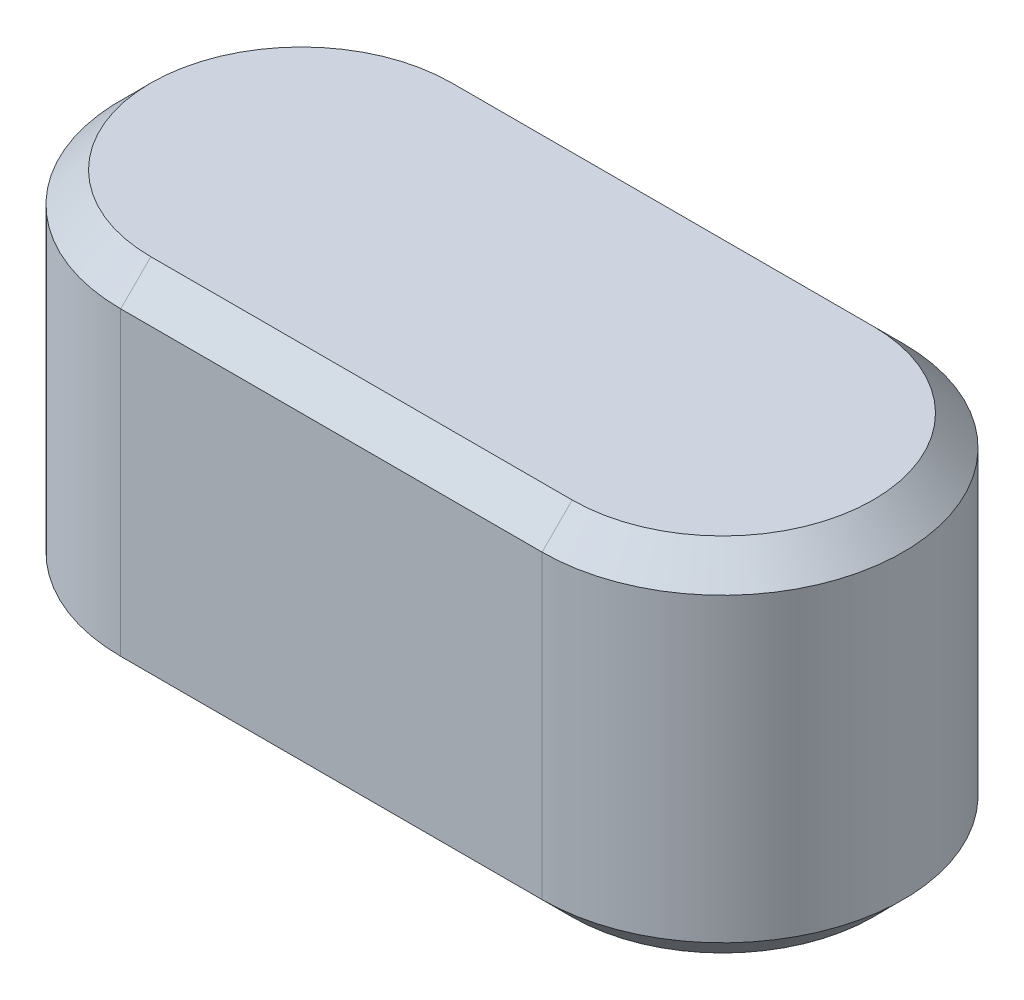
from build123d import *

# Parameters (mm, degrees)
BASE_EXTRUSION_DEPTH = 6
CHANFREIN1_0_5_SIZE  = 0.5


with BuildPart() as part:
    # Esquisse1 → Base-Extrusion (new body)
    with BuildSketch(Plane(origin=(0, 0, 0), x_dir=(1, 0, 0), z_dir=(0, 1, 0))):
        with BuildLine():
            Line((-3.5, 3), (3.5, 3))
            ThreePointArc((3.5, 3), (6.5, 0), (3.5, -3))
            Line((3.5, -3), (-3.5, -3))
            ThreePointArc((-3.5, -3), (-6.5, 0), (-3.5, 3))
        make_face()
    extrude(amount=BASE_EXTRUSION_DEPTH)

    # Chanfrein1-0.5
    chanfrein1_0_5_edges = [part.edges().sort_by_distance(p)[0] for p in [
        (-6.5, 0, 0),
        (-6.5, 6, 0),
        (0, 0, -3),
        (0, 6, -3),
        (6.5, 0, 0),
        (6.5, 6, 0),
        (0, 0, 3),
        (0, 6, 3),
    ]]
    chamfer(chanfrein1_0_5_edges, length=CHANFREIN1_0_5_SIZE)


solid = part.part
